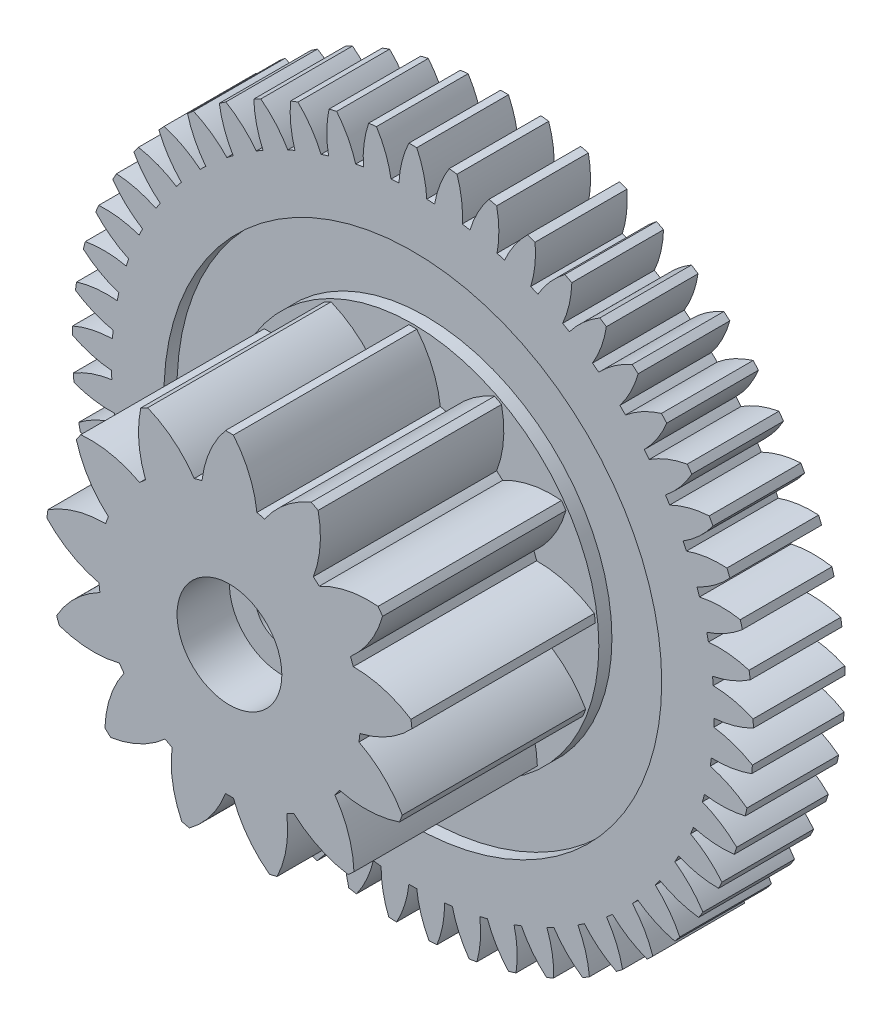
from build123d import *

# Parameters (mm, degrees)
ESQUISSE1_R                  = 13
BASE_EXTRUSION_DEPTH         = 3.5
ESQUISSE2_R                  = 7
BOSS_EXTRU_1_DEPTH           = 7
ENL_V_START                  = -7
ENL_V_MAT_EXTRU_1_DEPTH      = 7
R_P_TITION_CIRCULAIRE1_COUNT = 13
ENL_V_MAT_EXTRU_2_DEPTH      = 20.672315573
R_P_TITION_CIRCULAIRE2_COUNT = 53
ESQUISSE5_R                  = 1
ENL_V_MAT_EXTRU_3_DEPTH      = 22.170608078
ESQUISSE6_R                  = 2.25
ESQUISSE6_R_2                = 1
EXTRUSION1_DEPTH             = 0.5
ESQUISSE7_R                  = 9.5
ESQUISSE7_R_2                = 7.1
ENL_V_MAT_EXTRU_4_DEPTH      = 0.5
ESQUISSE9_R                  = 2
ENL_V_MAT_EXTRU_5_DEPTH      = 2


with BuildPart() as part:
    # Esquisse1 → Base-Extrusion (new body)
    with BuildSketch(Plane.XY):
        Circle(ESQUISSE1_R)
    extrude(amount=BASE_EXTRUSION_DEPTH)

    # Esquisse2 → Boss.-Extru.1 (add)
    with BuildSketch(Plane.XY.offset(3.5)):
        Circle(ESQUISSE2_R)
    extrude(amount=BOSS_EXTRU_1_DEPTH)

    # Esquisse3 → Enl_v. mat.-Extru.1 (cut)
    with BuildSketch(Plane.XY.offset(10.5).offset(ENL_V_START)):
        with BuildLine():
            Line((1.196578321, 4.854709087), (1.899812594, 7.707842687))
            Line((1.899812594, 7.707842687), (-1.899812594, 7.707842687))
            Line((-1.899812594, 7.707842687), (-1.196578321, 4.854709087))
            ThreePointArc((-1.196578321, 4.854709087), (-1.122815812, 4.872297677), (-1.048795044, 4.888765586))
            ThreePointArc((-1.048795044, 4.888765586), (-0.753812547, 6.009366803), (-0.15, 6.998392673))
            ThreePointArc((-0.15, 6.998392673), (0, 7), (0.15, 6.998392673))
            ThreePointArc((0.15, 6.998392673), (0.753812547, 6.009366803), (1.048795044, 4.888765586))
            ThreePointArc((1.048795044, 4.888765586), (1.122815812, 4.872297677), (1.196578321, 4.854709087))
        make_face()
    enl_v_mat_extru_1 = extrude(amount=ENL_V_MAT_EXTRU_1_DEPTH, mode=Mode.SUBTRACT)

    # R_p_tition circulaire1: Enl_v. mat.-Extru.1 ×13 about axis
    r_p_tition_circulaire1_axis = Axis((0, 0, 0), (0, 0, 1))
    for i in range(1, R_P_TITION_CIRCULAIRE1_COUNT):
        add(enl_v_mat_extru_1.rotate(r_p_tition_circulaire1_axis, i * 360 / R_P_TITION_CIRCULAIRE1_COUNT), mode=Mode.SUBTRACT)

    # Esquisse4 → Enl_v. mat.-Extru.2 (cut, through all)
    with BuildSketch(Plane.XY.offset(3.5)):
        with BuildLine():
            Line((0.681267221, 11.479802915), (0.888577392, 14.973116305))
            Line((0.888577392, 14.973116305), (-0.888577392, 14.973116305))
            Line((-0.888577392, 14.973116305), (-0.681267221, 11.479802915))
            ThreePointArc((-0.681267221, 11.479802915), (-0.60638286, 11.484001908), (-0.531472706, 11.487712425))
            ThreePointArc((-0.531472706, 11.487712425), (-0.415074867, 12.262186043), (-0.15, 12.999134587))
            ThreePointArc((-0.15, 12.999134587), (0, 13), (0.15, 12.999134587))
            ThreePointArc((0.15, 12.999134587), (0.415074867, 12.262186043), (0.531472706, 11.487712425))
            ThreePointArc((0.531472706, 11.487712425), (0.60638286, 11.484001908), (0.681267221, 11.479802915))
        make_face()
    enl_v_mat_extru_2 = extrude(amount=-ENL_V_MAT_EXTRU_2_DEPTH, mode=Mode.SUBTRACT)

    # R_p_tition circulaire2: Enl_v. mat.-Extru.2 ×53 about axis
    r_p_tition_circulaire2_axis = Axis((0, 0, 0), (0, 0, 1))
    for i in range(1, R_P_TITION_CIRCULAIRE2_COUNT):
        add(enl_v_mat_extru_2.rotate(r_p_tition_circulaire2_axis, i * 360 / R_P_TITION_CIRCULAIRE2_COUNT), mode=Mode.SUBTRACT)

    # Esquisse5 → Enl_v. mat.-Extru.3 (cut, through all)
    with BuildSketch(Plane.XY.offset(10.5)):
        Circle(ESQUISSE5_R)
    extrude(amount=-ENL_V_MAT_EXTRU_3_DEPTH, mode=Mode.SUBTRACT)

    # Esquisse6 → Extrusion1 (add)
    with BuildSketch(Plane(origin=(0, 0, 0), x_dir=(-1, 0, 0), z_dir=(0, 0, -1))):
        with Locations(Location((0, 0, 0), (0, 0, 180))):
            Circle(ESQUISSE6_R)
        with Locations(Location((0, 0, 0), (0, 0, 180))):
            Circle(ESQUISSE6_R_2, mode=Mode.SUBTRACT)
    extrude(amount=EXTRUSION1_DEPTH)

    # Esquisse7 → Enl_v. mat.-Extru.4 (cut)
    with BuildSketch(Plane.XY.offset(3.5)):
        Circle(ESQUISSE7_R)
        Circle(ESQUISSE7_R_2, mode=Mode.SUBTRACT)
    extrude(amount=-ENL_V_MAT_EXTRU_4_DEPTH, mode=Mode.SUBTRACT)

    # Esquisse9 → Enl_v. mat.-Extru.5 (cut)
    with BuildSketch(Plane.XY.offset(10.5)):
        Circle(ESQUISSE9_R)
    extrude(amount=-ENL_V_MAT_EXTRU_5_DEPTH, mode=Mode.SUBTRACT)


solid = part.part
